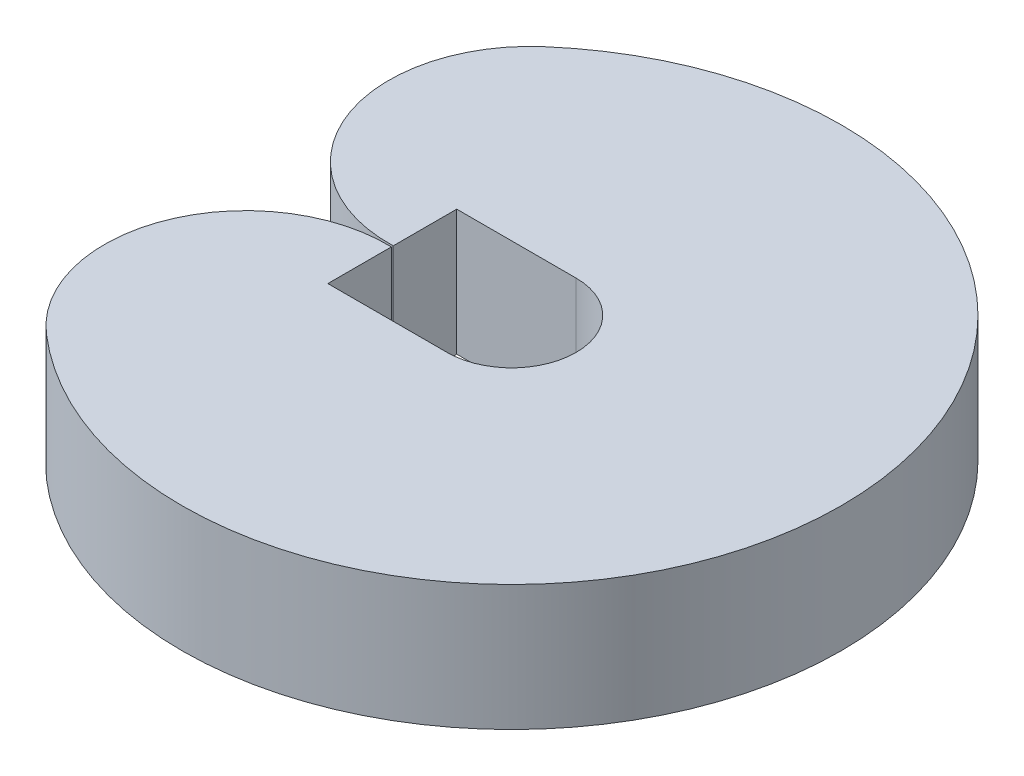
ISO-10303-21;
HEADER;
FILE_DESCRIPTION(('STEP AP214'),'2;1');
FILE_NAME('part.step','',(''),(''),'','','');
FILE_SCHEMA(('AUTOMOTIVE_DESIGN { 1 0 10303 214 1 1 1 1 }'));
ENDSEC;
DATA;
#1=APPLICATION_CONTEXT('core data for automotive mechanical design processes');
#2=APPLICATION_PROTOCOL_DEFINITION('international standard','automotive_design',2000,#1);
#3=PRODUCT_CONTEXT('',#1,'mechanical');
#4=PRODUCT('Part','Part','',(#3));
#5=PRODUCT_RELATED_PRODUCT_CATEGORY('part','',(#4));
#6=PRODUCT_DEFINITION_FORMATION('','',#4);
#7=PRODUCT_DEFINITION_CONTEXT('part definition',#1,'design');
#8=PRODUCT_DEFINITION('design','',#6,#7);
#9=PRODUCT_DEFINITION_SHAPE('','',#8);
#10=(LENGTH_UNIT() NAMED_UNIT(*) SI_UNIT(.MILLI.,.METRE.));
#11=(NAMED_UNIT(*) PLANE_ANGLE_UNIT() SI_UNIT($,.RADIAN.));
#12=(NAMED_UNIT(*) SI_UNIT($,.STERADIAN.) SOLID_ANGLE_UNIT());
#13=UNCERTAINTY_MEASURE_WITH_UNIT(LENGTH_MEASURE(1.E-05),#10,'distance_accuracy_value','');
#14=(GEOMETRIC_REPRESENTATION_CONTEXT(3) GLOBAL_UNCERTAINTY_ASSIGNED_CONTEXT((#13)) GLOBAL_UNIT_ASSIGNED_CONTEXT((#10,
#11,#12)) REPRESENTATION_CONTEXT('',''));
#15=CARTESIAN_POINT('',(0.,0.,0.));
#16=DIRECTION('',(0.,0.,1.));
#17=DIRECTION('',(1.,0.,0.));
#18=AXIS2_PLACEMENT_3D('',#15,#16,#17);
#19=CARTESIAN_POINT('',(-140.151572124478,210.243762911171,205.212085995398));
#20=DIRECTION('',(0.,0.,1.));
#21=DIRECTION('',(1.,0.,0.));
#22=AXIS2_PLACEMENT_3D('',#19,#20,#21);
#23=PLANE('',#22);
#24=DIRECTION('',(-1.,0.,0.));
#25=VECTOR('',#24,1.);
#26=CARTESIAN_POINT('',(-140.151572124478,-189.756237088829,205.212085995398));
#27=LINE('',#26,#25);
#28=CARTESIAN_POINT('',(-140.151572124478,-189.756237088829,205.212085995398));
#29=VERTEX_POINT('',#28);
#30=CARTESIAN_POINT('',(-520.151572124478,-189.756237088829,205.212085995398));
#31=VERTEX_POINT('',#30);
#32=EDGE_CURVE('E112',#29,#31,#27,.T.);
#33=ORIENTED_EDGE('',*,*,#32,.T.);
#34=DIRECTION('',(0.,-1.,0.));
#35=VECTOR('',#34,1.);
#36=CARTESIAN_POINT('',(-520.151572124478,210.243762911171,205.212085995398));
#37=LINE('',#36,#35);
#38=CARTESIAN_POINT('',(-520.151572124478,210.243762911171,205.212085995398));
#39=VERTEX_POINT('',#38);
#40=EDGE_CURVE('E10',#39,#31,#37,.T.);
#41=ORIENTED_EDGE('',*,*,#40,.F.);
#42=DIRECTION('',(-1.,0.,0.));
#43=VECTOR('',#42,1.);
#44=CARTESIAN_POINT('',(-140.151572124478,210.243762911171,205.212085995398));
#45=LINE('',#44,#43);
#46=CARTESIAN_POINT('',(-140.151572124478,210.243762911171,205.212085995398));
#47=VERTEX_POINT('',#46);
#48=EDGE_CURVE('E69',#47,#39,#45,.T.);
#49=ORIENTED_EDGE('',*,*,#48,.F.);
#50=DIRECTION('',(0.,-1.,0.));
#51=VECTOR('',#50,1.);
#52=CARTESIAN_POINT('',(-140.151572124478,210.243762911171,205.212085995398));
#53=LINE('',#52,#51);
#54=EDGE_CURVE('E32',#47,#29,#53,.T.);
#55=ORIENTED_EDGE('',*,*,#54,.T.);
#56=EDGE_LOOP('',(#33,#41,#49,#55));
#57=FACE_BOUND('',#56,.T.);
#58=ADVANCED_FACE('F16',(#57),#23,.F.);
#59=CARTESIAN_POINT('',(-520.151572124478,210.243762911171,0.));
#60=DIRECTION('',(1.,0.,0.));
#61=DIRECTION('',(0.,0.,-1.));
#62=AXIS2_PLACEMENT_3D('',#59,#60,#61);
#63=PLANE('',#62);
#64=DIRECTION('',(0.,0.,1.));
#65=VECTOR('',#64,1.);
#66=CARTESIAN_POINT('',(-520.151572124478,-189.756237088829,0.));
#67=LINE('',#66,#65);
#68=CARTESIAN_POINT('',(-520.151572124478,-189.756237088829,3.03237847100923));
#69=VERTEX_POINT('',#68);
#70=EDGE_CURVE('E114',#69,#31,#67,.T.);
#71=ORIENTED_EDGE('',*,*,#70,.F.);
#72=DIRECTION('',(0.,-1.,0.));
#73=VECTOR('',#72,1.);
#74=CARTESIAN_POINT('',(-520.151572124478,210.243762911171,3.03237847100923));
#75=LINE('',#74,#73);
#76=CARTESIAN_POINT('',(-520.151572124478,210.243762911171,3.03237847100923));
#77=VERTEX_POINT('',#76);
#78=EDGE_CURVE('E24',#77,#69,#75,.T.);
#79=ORIENTED_EDGE('',*,*,#78,.F.);
#80=DIRECTION('',(0.,0.,1.));
#81=VECTOR('',#80,1.);
#82=CARTESIAN_POINT('',(-520.151572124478,210.243762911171,0.));
#83=LINE('',#82,#81);
#84=EDGE_CURVE('E104',#77,#39,#83,.T.);
#85=ORIENTED_EDGE('',*,*,#84,.T.);
#86=ORIENTED_EDGE('',*,*,#40,.T.);
#87=EDGE_LOOP('',(#71,#79,#85,#86));
#88=FACE_BOUND('',#87,.T.);
#89=ADVANCED_FACE('F150',(#88),#63,.T.);
#90=CARTESIAN_POINT('',(-533.786989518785,210.243762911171,452.825748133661));
#91=DIRECTION('',(0.,-1.,0.));
#92=DIRECTION('',(0.,0.,-1.));
#93=AXIS2_PLACEMENT_3D('',#90,#91,#92);
#94=CYLINDRICAL_SURFACE('',#93,450.);
#95=CARTESIAN_POINT('',(-533.786989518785,-189.756237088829,452.825748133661));
#96=DIRECTION('',(0.,1.,0.));
#97=DIRECTION('',(0.,0.,1.));
#98=AXIS2_PLACEMENT_3D('',#95,#96,#97);
#99=CIRCLE('',#98,450.);
#100=CARTESIAN_POINT('',(-829.013552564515,-189.756237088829,792.445059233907));
#101=VERTEX_POINT('',#100);
#102=EDGE_CURVE('E117',#69,#101,#99,.T.);
#103=ORIENTED_EDGE('',*,*,#102,.T.);
#104=DIRECTION('',(0.,-1.,0.));
#105=VECTOR('',#104,1.);
#106=CARTESIAN_POINT('',(-829.013552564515,210.243762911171,792.445059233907));
#107=LINE('',#106,#105);
#108=CARTESIAN_POINT('',(-829.013552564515,210.243762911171,792.445059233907));
#109=VERTEX_POINT('',#108);
#110=EDGE_CURVE('E135',#109,#101,#107,.T.);
#111=ORIENTED_EDGE('',*,*,#110,.F.);
#112=CARTESIAN_POINT('',(-533.786989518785,210.243762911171,452.825748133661));
#113=DIRECTION('',(0.,1.,0.));
#114=DIRECTION('',(0.,0.,1.));
#115=AXIS2_PLACEMENT_3D('',#112,#113,#114);
#116=CIRCLE('',#115,450.);
#117=EDGE_CURVE('E142',#77,#109,#116,.T.);
#118=ORIENTED_EDGE('',*,*,#117,.F.);
#119=ORIENTED_EDGE('',*,*,#78,.T.);
#120=EDGE_LOOP('',(#103,#111,#118,#119));
#121=FACE_BOUND('',#120,.T.);
#122=ADVANCED_FACE('F140',(#121),#94,.T.);
#123=CARTESIAN_POINT('',(-140.151572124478,210.243762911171,0.));
#124=DIRECTION('',(0.,-1.,0.));
#125=DIRECTION('',(0.,0.,-1.));
#126=AXIS2_PLACEMENT_3D('',#123,#124,#125);
#127=CYLINDRICAL_SURFACE('',#126,1050.);
#128=CARTESIAN_POINT('',(-140.151572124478,-189.756237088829,0.));
#129=DIRECTION('',(0.,1.,0.));
#130=DIRECTION('',(0.,0.,1.));
#131=AXIS2_PLACEMENT_3D('',#128,#129,#130);
#132=CIRCLE('',#131,1050.);
#133=CARTESIAN_POINT('',(-829.013552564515,-189.756237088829,-792.445059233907));
#134=VERTEX_POINT('',#133);
#135=EDGE_CURVE('E119',#101,#134,#132,.T.);
#136=ORIENTED_EDGE('',*,*,#135,.T.);
#137=DIRECTION('',(0.,-1.,0.));
#138=VECTOR('',#137,1.);
#139=CARTESIAN_POINT('',(-829.013552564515,210.243762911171,-792.445059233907));
#140=LINE('',#139,#138);
#141=CARTESIAN_POINT('',(-829.013552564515,210.243762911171,-792.445059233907));
#142=VERTEX_POINT('',#141);
#143=EDGE_CURVE('E132',#142,#134,#140,.T.);
#144=ORIENTED_EDGE('',*,*,#143,.F.);
#145=CARTESIAN_POINT('',(-140.151572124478,210.243762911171,0.));
#146=DIRECTION('',(0.,1.,0.));
#147=DIRECTION('',(0.,0.,1.));
#148=AXIS2_PLACEMENT_3D('',#145,#146,#147);
#149=CIRCLE('',#148,1050.);
#150=EDGE_CURVE('E185',#109,#142,#149,.T.);
#151=ORIENTED_EDGE('',*,*,#150,.F.);
#152=ORIENTED_EDGE('',*,*,#110,.T.);
#153=EDGE_LOOP('',(#136,#144,#151,#152));
#154=FACE_BOUND('',#153,.T.);
#155=ADVANCED_FACE('F170',(#154),#127,.T.);
#156=CARTESIAN_POINT('',(-533.786989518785,210.243762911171,-452.825748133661));
#157=DIRECTION('',(0.,-1.,0.));
#158=DIRECTION('',(0.,0.,-1.));
#159=AXIS2_PLACEMENT_3D('',#156,#157,#158);
#160=CYLINDRICAL_SURFACE('',#159,450.);
#161=CARTESIAN_POINT('',(-533.786989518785,-189.756237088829,-452.825748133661));
#162=DIRECTION('',(0.,1.,0.));
#163=DIRECTION('',(0.,0.,1.));
#164=AXIS2_PLACEMENT_3D('',#161,#162,#163);
#165=CIRCLE('',#164,450.);
#166=CARTESIAN_POINT('',(-520.151572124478,-189.756237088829,-3.03237847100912));
#167=VERTEX_POINT('',#166);
#168=EDGE_CURVE('E121',#134,#167,#165,.T.);
#169=ORIENTED_EDGE('',*,*,#168,.T.);
#170=DIRECTION('',(0.,-1.,0.));
#171=VECTOR('',#170,1.);
#172=CARTESIAN_POINT('',(-520.151572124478,210.243762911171,-3.03237847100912));
#173=LINE('',#172,#171);
#174=CARTESIAN_POINT('',(-520.151572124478,210.243762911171,-3.03237847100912));
#175=VERTEX_POINT('',#174);
#176=EDGE_CURVE('E95',#175,#167,#173,.T.);
#177=ORIENTED_EDGE('',*,*,#176,.F.);
#178=CARTESIAN_POINT('',(-533.786989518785,210.243762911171,-452.825748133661));
#179=DIRECTION('',(0.,1.,0.));
#180=DIRECTION('',(0.,0.,1.));
#181=AXIS2_PLACEMENT_3D('',#178,#179,#180);
#182=CIRCLE('',#181,450.);
#183=EDGE_CURVE('E101',#142,#175,#182,.T.);
#184=ORIENTED_EDGE('',*,*,#183,.F.);
#185=ORIENTED_EDGE('',*,*,#143,.T.);
#186=EDGE_LOOP('',(#169,#177,#184,#185));
#187=FACE_BOUND('',#186,.T.);
#188=ADVANCED_FACE('F173',(#187),#160,.T.);
#189=CARTESIAN_POINT('',(-520.151572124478,-189.756237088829,-205.212085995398));
#190=VERTEX_POINT('',#189);
#191=EDGE_CURVE('E91',#190,#167,#67,.T.);
#192=ORIENTED_EDGE('',*,*,#191,.F.);
#193=DIRECTION('',(0.,-1.,0.));
#194=VECTOR('',#193,1.);
#195=CARTESIAN_POINT('',(-520.151572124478,210.243762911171,-205.212085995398));
#196=LINE('',#195,#194);
#197=CARTESIAN_POINT('',(-520.151572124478,210.243762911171,-205.212085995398));
#198=VERTEX_POINT('',#197);
#199=EDGE_CURVE('E86',#198,#190,#196,.T.);
#200=ORIENTED_EDGE('',*,*,#199,.F.);
#201=EDGE_CURVE('E89',#198,#175,#83,.T.);
#202=ORIENTED_EDGE('',*,*,#201,.T.);
#203=ORIENTED_EDGE('',*,*,#176,.T.);
#204=EDGE_LOOP('',(#192,#200,#202,#203));
#205=FACE_BOUND('',#204,.T.);
#206=ADVANCED_FACE('F88',(#205),#63,.T.);
#207=CARTESIAN_POINT('',(-140.151572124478,210.243762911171,-205.212085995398));
#208=DIRECTION('',(0.,0.,1.));
#209=DIRECTION('',(1.,0.,0.));
#210=AXIS2_PLACEMENT_3D('',#207,#208,#209);
#211=PLANE('',#210);
#212=DIRECTION('',(-1.,0.,0.));
#213=VECTOR('',#212,1.);
#214=CARTESIAN_POINT('',(-140.151572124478,-189.756237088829,-205.212085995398));
#215=LINE('',#214,#213);
#216=CARTESIAN_POINT('',(-140.151572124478,-189.756237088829,-205.212085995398));
#217=VERTEX_POINT('',#216);
#218=EDGE_CURVE('E124',#217,#190,#215,.T.);
#219=ORIENTED_EDGE('',*,*,#218,.F.);
#220=DIRECTION('',(0.,-1.,0.));
#221=VECTOR('',#220,1.);
#222=CARTESIAN_POINT('',(-140.151572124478,210.243762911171,-205.212085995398));
#223=LINE('',#222,#221);
#224=CARTESIAN_POINT('',(-140.151572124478,210.243762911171,-205.212085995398));
#225=VERTEX_POINT('',#224);
#226=EDGE_CURVE('E57',#225,#217,#223,.T.);
#227=ORIENTED_EDGE('',*,*,#226,.F.);
#228=DIRECTION('',(-1.,0.,0.));
#229=VECTOR('',#228,1.);
#230=CARTESIAN_POINT('',(-140.151572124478,210.243762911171,-205.212085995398));
#231=LINE('',#230,#229);
#232=EDGE_CURVE('E99',#225,#198,#231,.T.);
#233=ORIENTED_EDGE('',*,*,#232,.T.);
#234=ORIENTED_EDGE('',*,*,#199,.T.);
#235=EDGE_LOOP('',(#219,#227,#233,#234));
#236=FACE_BOUND('',#235,.T.);
#237=ADVANCED_FACE('F105',(#236),#211,.T.);
#238=CARTESIAN_POINT('',(-140.151572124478,210.243762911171,0.));
#239=DIRECTION('',(0.,-1.,0.));
#240=DIRECTION('',(0.,0.,-1.));
#241=AXIS2_PLACEMENT_3D('',#238,#239,#240);
#242=CYLINDRICAL_SURFACE('',#241,205.212085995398);
#243=CARTESIAN_POINT('',(-140.151572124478,-189.756237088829,0.));
#244=DIRECTION('',(0.,1.,0.));
#245=DIRECTION('',(0.,0.,1.));
#246=AXIS2_PLACEMENT_3D('',#243,#244,#245);
#247=CIRCLE('',#246,205.212085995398);
#248=EDGE_CURVE('E126',#29,#217,#247,.T.);
#249=ORIENTED_EDGE('',*,*,#248,.F.);
#250=ORIENTED_EDGE('',*,*,#54,.F.);
#251=CARTESIAN_POINT('',(-140.151572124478,210.243762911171,0.));
#252=DIRECTION('',(0.,1.,0.));
#253=DIRECTION('',(0.,0.,1.));
#254=AXIS2_PLACEMENT_3D('',#251,#252,#253);
#255=CIRCLE('',#254,205.212085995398);
#256=EDGE_CURVE('E106',#47,#225,#255,.T.);
#257=ORIENTED_EDGE('',*,*,#256,.T.);
#258=ORIENTED_EDGE('',*,*,#226,.T.);
#259=EDGE_LOOP('',(#249,#250,#257,#258));
#260=FACE_BOUND('',#259,.T.);
#261=ADVANCED_FACE('F151',(#260),#242,.F.);
#262=CARTESIAN_POINT('',(-140.151572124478,210.243762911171,0.));
#263=DIRECTION('',(0.,1.,0.));
#264=DIRECTION('',(0.,0.,1.));
#265=AXIS2_PLACEMENT_3D('',#262,#263,#264);
#266=PLANE('',#265);
#267=ORIENTED_EDGE('',*,*,#48,.T.);
#268=ORIENTED_EDGE('',*,*,#84,.F.);
#269=ORIENTED_EDGE('',*,*,#117,.T.);
#270=ORIENTED_EDGE('',*,*,#150,.T.);
#271=ORIENTED_EDGE('',*,*,#183,.T.);
#272=ORIENTED_EDGE('',*,*,#201,.F.);
#273=ORIENTED_EDGE('',*,*,#232,.F.);
#274=ORIENTED_EDGE('',*,*,#256,.F.);
#275=EDGE_LOOP('',(#267,#268,#269,#270,#271,#272,#273,#274));
#276=FACE_BOUND('',#275,.T.);
#277=ADVANCED_FACE('F98',(#276),#266,.T.);
#278=CARTESIAN_POINT('',(-140.151572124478,-189.756237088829,0.));
#279=DIRECTION('',(0.,1.,0.));
#280=DIRECTION('',(0.,0.,1.));
#281=AXIS2_PLACEMENT_3D('',#278,#279,#280);
#282=PLANE('',#281);
#283=ORIENTED_EDGE('',*,*,#32,.F.);
#284=ORIENTED_EDGE('',*,*,#248,.T.);
#285=ORIENTED_EDGE('',*,*,#218,.T.);
#286=ORIENTED_EDGE('',*,*,#191,.T.);
#287=ORIENTED_EDGE('',*,*,#168,.F.);
#288=ORIENTED_EDGE('',*,*,#135,.F.);
#289=ORIENTED_EDGE('',*,*,#102,.F.);
#290=ORIENTED_EDGE('',*,*,#70,.T.);
#291=EDGE_LOOP('',(#283,#284,#285,#286,#287,#288,#289,#290));
#292=FACE_BOUND('',#291,.T.);
#293=ADVANCED_FACE('F148',(#292),#282,.F.);
#294=CLOSED_SHELL('',(#58,#89,#122,#155,#188,#206,#237,#261,#277,#293));
#295=MANIFOLD_SOLID_BREP('B1',#294);
#296=ADVANCED_BREP_SHAPE_REPRESENTATION('',(#18,#295),#14);
#297=SHAPE_DEFINITION_REPRESENTATION(#9,#296);
ENDSEC;
END-ISO-10303-21;
